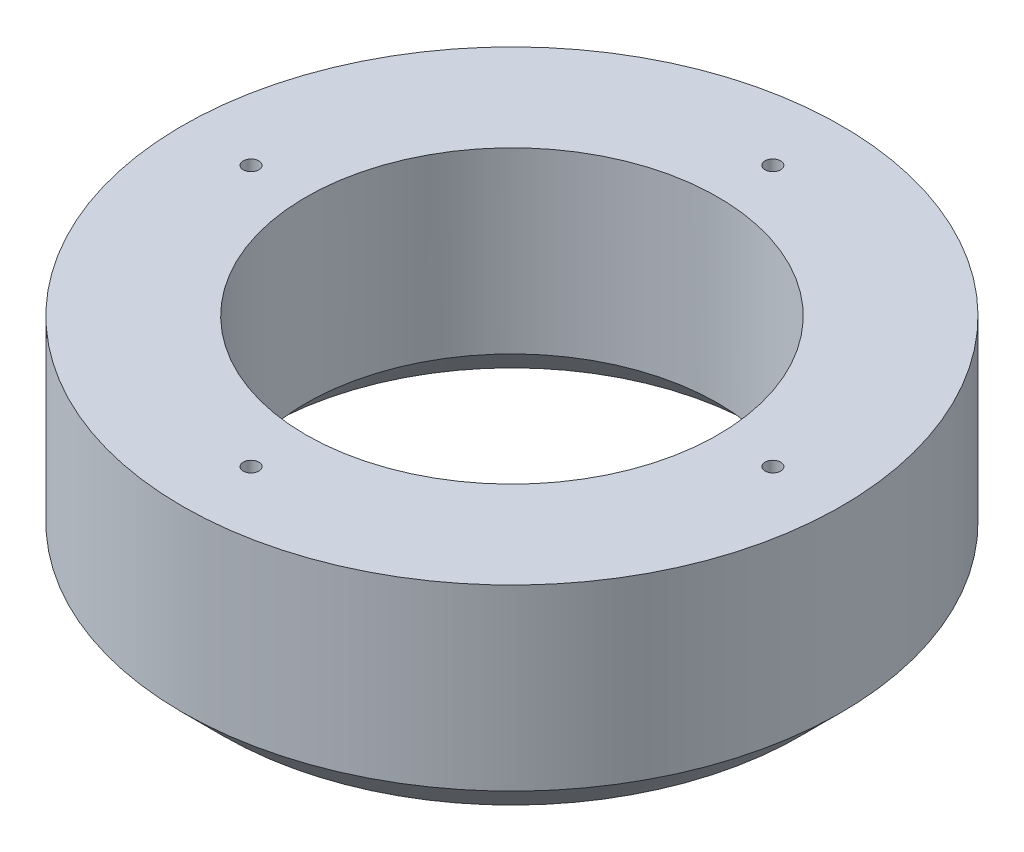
ISO-10303-21;
HEADER;
FILE_DESCRIPTION(('STEP AP214'),'2;1');
FILE_NAME('part.step','',(''),(''),'','','');
FILE_SCHEMA(('AUTOMOTIVE_DESIGN { 1 0 10303 214 1 1 1 1 }'));
ENDSEC;
DATA;
#1=APPLICATION_CONTEXT('core data for automotive mechanical design processes');
#2=APPLICATION_PROTOCOL_DEFINITION('international standard','automotive_design',2000,#1);
#3=PRODUCT_CONTEXT('',#1,'mechanical');
#4=PRODUCT('Part','Part','',(#3));
#5=PRODUCT_RELATED_PRODUCT_CATEGORY('part','',(#4));
#6=PRODUCT_DEFINITION_FORMATION('','',#4);
#7=PRODUCT_DEFINITION_CONTEXT('part definition',#1,'design');
#8=PRODUCT_DEFINITION('design','',#6,#7);
#9=PRODUCT_DEFINITION_SHAPE('','',#8);
#10=(LENGTH_UNIT() NAMED_UNIT(*) SI_UNIT(.MILLI.,.METRE.));
#11=(NAMED_UNIT(*) PLANE_ANGLE_UNIT() SI_UNIT($,.RADIAN.));
#12=(NAMED_UNIT(*) SI_UNIT($,.STERADIAN.) SOLID_ANGLE_UNIT());
#13=UNCERTAINTY_MEASURE_WITH_UNIT(LENGTH_MEASURE(1.E-05),#10,'distance_accuracy_value','');
#14=(GEOMETRIC_REPRESENTATION_CONTEXT(3) GLOBAL_UNCERTAINTY_ASSIGNED_CONTEXT((#13)) GLOBAL_UNIT_ASSIGNED_CONTEXT((#10,
#11,#12)) REPRESENTATION_CONTEXT('',''));
#15=CARTESIAN_POINT('',(0.,0.,0.));
#16=DIRECTION('',(0.,0.,1.));
#17=DIRECTION('',(1.,0.,0.));
#18=AXIS2_PLACEMENT_3D('',#15,#16,#17);
#19=CARTESIAN_POINT('',(0.,0.,0.));
#20=DIRECTION('',(0.,1.,0.));
#21=DIRECTION('',(0.,0.,1.));
#22=AXIS2_PLACEMENT_3D('',#19,#20,#21);
#23=CYLINDRICAL_SURFACE('',#22,381.);
#24=CARTESIAN_POINT('',(0.,-330.2,0.));
#25=DIRECTION('',(0.,1.,0.));
#26=DIRECTION('',(0.,0.,1.));
#27=AXIS2_PLACEMENT_3D('',#24,#25,#26);
#28=CIRCLE('',#27,381.);
#29=CARTESIAN_POINT('',(0.,-330.2,-381.));
#30=VERTEX_POINT('',#29);
#31=EDGE_CURVE('E10',#30,#30,#28,.F.);
#32=ORIENTED_EDGE('',*,*,#31,.T.);
#33=EDGE_LOOP('',(#32));
#34=FACE_BOUND('',#33,.T.);
#35=CARTESIAN_POINT('',(0.,0.,0.));
#36=DIRECTION('',(0.,1.,0.));
#37=DIRECTION('',(0.,0.,1.));
#38=AXIS2_PLACEMENT_3D('',#35,#36,#37);
#39=CIRCLE('',#38,381.);
#40=CARTESIAN_POINT('',(0.,0.,381.));
#41=VERTEX_POINT('',#40);
#42=EDGE_CURVE('E46',#41,#41,#39,.T.);
#43=ORIENTED_EDGE('',*,*,#42,.T.);
#44=EDGE_LOOP('',(#43));
#45=FACE_BOUND('',#44,.T.);
#46=ADVANCED_FACE('F24',(#34,#45),#23,.F.);
#47=CARTESIAN_POINT('',(381.,-406.4,0.));
#48=DIRECTION('',(0.,1.,0.));
#49=DIRECTION('',(0.,0.,1.));
#50=AXIS2_PLACEMENT_3D('',#47,#48,#49);
#51=PLANE('',#50);
#52=CARTESIAN_POINT('',(5.05496961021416E-12,-406.4,-482.6));
#53=DIRECTION('',(0.,1.,0.));
#54=DIRECTION('',(1.,0.,0.));
#55=AXIS2_PLACEMENT_3D('',#52,#53,#54);
#56=CIRCLE('',#55,14.4145);
#57=CARTESIAN_POINT('',(14.414500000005,-406.4,-482.6));
#58=VERTEX_POINT('',#57);
#59=EDGE_CURVE('E67',#58,#58,#56,.T.);
#60=ORIENTED_EDGE('',*,*,#59,.T.);
#61=EDGE_LOOP('',(#60));
#62=FACE_BOUND('',#61,.T.);
#63=CARTESIAN_POINT('',(-482.6,-406.4,-3.36997974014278E-12));
#64=DIRECTION('',(0.,1.,0.));
#65=DIRECTION('',(0.,0.,-1.));
#66=AXIS2_PLACEMENT_3D('',#63,#64,#65);
#67=CIRCLE('',#66,14.4145);
#68=CARTESIAN_POINT('',(-482.6,-406.4,-14.4145000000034));
#69=VERTEX_POINT('',#68);
#70=EDGE_CURVE('E61',#69,#69,#67,.T.);
#71=ORIENTED_EDGE('',*,*,#70,.T.);
#72=EDGE_LOOP('',(#71));
#73=FACE_BOUND('',#72,.T.);
#74=CARTESIAN_POINT('',(-1.68498987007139E-12,-406.4,482.6));
#75=DIRECTION('',(0.,1.,0.));
#76=DIRECTION('',(-1.,0.,0.));
#77=AXIS2_PLACEMENT_3D('',#74,#75,#76);
#78=CIRCLE('',#77,14.4145);
#79=CARTESIAN_POINT('',(-14.4145000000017,-406.4,482.6));
#80=VERTEX_POINT('',#79);
#81=EDGE_CURVE('E55',#80,#80,#78,.T.);
#82=ORIENTED_EDGE('',*,*,#81,.T.);
#83=EDGE_LOOP('',(#82));
#84=FACE_BOUND('',#83,.T.);
#85=CARTESIAN_POINT('',(482.6,-406.4,0.));
#86=DIRECTION('',(0.,1.,0.));
#87=DIRECTION('',(0.,0.,1.));
#88=AXIS2_PLACEMENT_3D('',#85,#86,#87);
#89=CIRCLE('',#88,14.4145);
#90=CARTESIAN_POINT('',(482.6,-406.4,14.4145));
#91=VERTEX_POINT('',#90);
#92=EDGE_CURVE('E49',#91,#91,#89,.T.);
#93=ORIENTED_EDGE('',*,*,#92,.T.);
#94=EDGE_LOOP('',(#93));
#95=FACE_BOUND('',#94,.T.);
#96=CARTESIAN_POINT('',(0.,-406.4,0.));
#97=DIRECTION('',(0.,1.,0.));
#98=DIRECTION('',(0.,0.,1.));
#99=AXIS2_PLACEMENT_3D('',#96,#97,#98);
#100=CIRCLE('',#99,457.2);
#101=CARTESIAN_POINT('',(0.,-406.4,-457.2));
#102=VERTEX_POINT('',#101);
#103=EDGE_CURVE('E30',#102,#102,#100,.T.);
#104=ORIENTED_EDGE('',*,*,#103,.T.);
#105=EDGE_LOOP('',(#104));
#106=FACE_BOUND('',#105,.T.);
#107=CARTESIAN_POINT('',(0.,-406.4,0.));
#108=DIRECTION('',(0.,1.,0.));
#109=DIRECTION('',(0.,0.,1.));
#110=AXIS2_PLACEMENT_3D('',#107,#108,#109);
#111=CIRCLE('',#110,533.4);
#112=CARTESIAN_POINT('',(0.,-406.4,533.4));
#113=VERTEX_POINT('',#112);
#114=EDGE_CURVE('E34',#113,#113,#111,.F.);
#115=ORIENTED_EDGE('',*,*,#114,.T.);
#116=EDGE_LOOP('',(#115));
#117=FACE_BOUND('',#116,.T.);
#118=ADVANCED_FACE('F93',(#62,#73,#84,#95,#106,#117),#51,.F.);
#119=CARTESIAN_POINT('',(0.,0.,0.));
#120=DIRECTION('',(0.,1.,0.));
#121=DIRECTION('',(0.,0.,1.));
#122=AXIS2_PLACEMENT_3D('',#119,#120,#121);
#123=CYLINDRICAL_SURFACE('',#122,609.6);
#124=CARTESIAN_POINT('',(0.,-330.2,0.));
#125=DIRECTION('',(0.,1.,0.));
#126=DIRECTION('',(0.,0.,1.));
#127=AXIS2_PLACEMENT_3D('',#124,#125,#126);
#128=CIRCLE('',#127,609.6);
#129=CARTESIAN_POINT('',(0.,-330.2,609.6));
#130=VERTEX_POINT('',#129);
#131=EDGE_CURVE('E38',#130,#130,#128,.T.);
#132=ORIENTED_EDGE('',*,*,#131,.T.);
#133=EDGE_LOOP('',(#132));
#134=FACE_BOUND('',#133,.T.);
#135=CARTESIAN_POINT('',(0.,0.,0.));
#136=DIRECTION('',(0.,1.,0.));
#137=DIRECTION('',(0.,0.,1.));
#138=AXIS2_PLACEMENT_3D('',#135,#136,#137);
#139=CIRCLE('',#138,609.6);
#140=CARTESIAN_POINT('',(0.,0.,609.6));
#141=VERTEX_POINT('',#140);
#142=EDGE_CURVE('E43',#141,#141,#139,.T.);
#143=ORIENTED_EDGE('',*,*,#142,.F.);
#144=EDGE_LOOP('',(#143));
#145=FACE_BOUND('',#144,.T.);
#146=ADVANCED_FACE('F80',(#134,#145),#123,.T.);
#147=CARTESIAN_POINT('',(381.,0.,0.));
#148=DIRECTION('',(0.,-1.,0.));
#149=DIRECTION('',(0.,0.,-1.));
#150=AXIS2_PLACEMENT_3D('',#147,#148,#149);
#151=PLANE('',#150);
#152=CARTESIAN_POINT('',(5.05496961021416E-12,0.,-482.6));
#153=DIRECTION('',(0.,1.,0.));
#154=DIRECTION('',(1.,0.,0.));
#155=AXIS2_PLACEMENT_3D('',#152,#153,#154);
#156=CIRCLE('',#155,14.4145);
#157=CARTESIAN_POINT('',(14.414500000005,0.,-482.6));
#158=VERTEX_POINT('',#157);
#159=EDGE_CURVE('E70',#158,#158,#156,.T.);
#160=ORIENTED_EDGE('',*,*,#159,.F.);
#161=EDGE_LOOP('',(#160));
#162=FACE_BOUND('',#161,.T.);
#163=CARTESIAN_POINT('',(-482.6,0.,-3.36997974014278E-12));
#164=DIRECTION('',(0.,1.,0.));
#165=DIRECTION('',(0.,0.,-1.));
#166=AXIS2_PLACEMENT_3D('',#163,#164,#165);
#167=CIRCLE('',#166,14.4145);
#168=CARTESIAN_POINT('',(-482.6,0.,-14.4145000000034));
#169=VERTEX_POINT('',#168);
#170=EDGE_CURVE('E64',#169,#169,#167,.T.);
#171=ORIENTED_EDGE('',*,*,#170,.F.);
#172=EDGE_LOOP('',(#171));
#173=FACE_BOUND('',#172,.T.);
#174=CARTESIAN_POINT('',(-1.68498987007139E-12,0.,482.6));
#175=DIRECTION('',(0.,1.,0.));
#176=DIRECTION('',(-1.,0.,0.));
#177=AXIS2_PLACEMENT_3D('',#174,#175,#176);
#178=CIRCLE('',#177,14.4145);
#179=CARTESIAN_POINT('',(-14.4145000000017,0.,482.6));
#180=VERTEX_POINT('',#179);
#181=EDGE_CURVE('E58',#180,#180,#178,.T.);
#182=ORIENTED_EDGE('',*,*,#181,.F.);
#183=EDGE_LOOP('',(#182));
#184=FACE_BOUND('',#183,.T.);
#185=CARTESIAN_POINT('',(482.6,0.,0.));
#186=DIRECTION('',(0.,1.,0.));
#187=DIRECTION('',(0.,0.,1.));
#188=AXIS2_PLACEMENT_3D('',#185,#186,#187);
#189=CIRCLE('',#188,14.4145);
#190=CARTESIAN_POINT('',(482.6,0.,14.4145));
#191=VERTEX_POINT('',#190);
#192=EDGE_CURVE('E52',#191,#191,#189,.T.);
#193=ORIENTED_EDGE('',*,*,#192,.F.);
#194=EDGE_LOOP('',(#193));
#195=FACE_BOUND('',#194,.T.);
#196=ORIENTED_EDGE('',*,*,#42,.F.);
#197=EDGE_LOOP('',(#196));
#198=FACE_BOUND('',#197,.T.);
#199=ORIENTED_EDGE('',*,*,#142,.T.);
#200=EDGE_LOOP('',(#199));
#201=FACE_BOUND('',#200,.T.);
#202=ADVANCED_FACE('F76',(#162,#173,#184,#195,#198,#201),#151,.F.);
#203=CARTESIAN_POINT('',(0.,-330.2,0.));
#204=DIRECTION('',(0.,1.,0.));
#205=DIRECTION('',(0.,0.,1.));
#206=AXIS2_PLACEMENT_3D('',#203,#204,#205);
#207=CONICAL_SURFACE('',#206,609.6,0.785398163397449);
#208=ORIENTED_EDGE('',*,*,#114,.F.);
#209=EDGE_LOOP('',(#208));
#210=FACE_BOUND('',#209,.T.);
#211=ORIENTED_EDGE('',*,*,#131,.F.);
#212=EDGE_LOOP('',(#211));
#213=FACE_BOUND('',#212,.T.);
#214=ADVANCED_FACE('F79',(#210,#213),#207,.T.);
#215=CARTESIAN_POINT('',(0.,-406.4,0.));
#216=DIRECTION('',(0.,-1.,0.));
#217=DIRECTION('',(0.,0.,-1.));
#218=AXIS2_PLACEMENT_3D('',#215,#216,#217);
#219=CONICAL_SURFACE('',#218,457.2,0.785398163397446);
#220=CARTESIAN_POINT('',(0.,-330.2,-381.));
#221=CARTESIAN_POINT('',(0.,-330.99375,-381.79375));
#222=CARTESIAN_POINT('',(0.,-331.7875,-382.5875));
#223=CARTESIAN_POINT('',(0.,-333.375,-384.175));
#224=CARTESIAN_POINT('',(0.,-334.16875,-384.96875));
#225=CARTESIAN_POINT('',(0.,-335.75625,-386.55625));
#226=CARTESIAN_POINT('',(0.,-336.55,-387.35));
#227=CARTESIAN_POINT('',(0.,-338.1375,-388.9375));
#228=CARTESIAN_POINT('',(0.,-338.93125,-389.73125));
#229=CARTESIAN_POINT('',(0.,-340.51875,-391.31875));
#230=CARTESIAN_POINT('',(0.,-341.3125,-392.1125));
#231=CARTESIAN_POINT('',(0.,-342.9,-393.7));
#232=CARTESIAN_POINT('',(0.,-343.69375,-394.49375));
#233=CARTESIAN_POINT('',(0.,-345.28125,-396.08125));
#234=CARTESIAN_POINT('',(0.,-346.075,-396.875));
#235=CARTESIAN_POINT('',(0.,-347.6625,-398.4625));
#236=CARTESIAN_POINT('',(0.,-348.45625,-399.25625));
#237=CARTESIAN_POINT('',(0.,-350.04375,-400.84375));
#238=CARTESIAN_POINT('',(0.,-350.8375,-401.6375));
#239=CARTESIAN_POINT('',(0.,-352.425,-403.225));
#240=CARTESIAN_POINT('',(0.,-353.21875,-404.01875));
#241=CARTESIAN_POINT('',(0.,-354.80625,-405.60625));
#242=CARTESIAN_POINT('',(0.,-355.6,-406.4));
#243=CARTESIAN_POINT('',(0.,-357.1875,-407.9875));
#244=CARTESIAN_POINT('',(0.,-357.98125,-408.78125));
#245=CARTESIAN_POINT('',(0.,-359.56875,-410.36875));
#246=CARTESIAN_POINT('',(0.,-360.3625,-411.1625));
#247=CARTESIAN_POINT('',(0.,-361.95,-412.75));
#248=CARTESIAN_POINT('',(0.,-362.74375,-413.54375));
#249=CARTESIAN_POINT('',(0.,-364.33125,-415.13125));
#250=CARTESIAN_POINT('',(0.,-365.125,-415.925));
#251=CARTESIAN_POINT('',(0.,-366.7125,-417.5125));
#252=CARTESIAN_POINT('',(0.,-367.50625,-418.30625));
#253=CARTESIAN_POINT('',(0.,-369.09375,-419.89375));
#254=CARTESIAN_POINT('',(0.,-369.8875,-420.6875));
#255=CARTESIAN_POINT('',(0.,-371.475,-422.275));
#256=CARTESIAN_POINT('',(0.,-372.26875,-423.06875));
#257=CARTESIAN_POINT('',(0.,-373.85625,-424.65625));
#258=CARTESIAN_POINT('',(0.,-374.65,-425.45));
#259=CARTESIAN_POINT('',(0.,-376.2375,-427.0375));
#260=CARTESIAN_POINT('',(0.,-377.03125,-427.83125));
#261=CARTESIAN_POINT('',(0.,-378.61875,-429.41875));
#262=CARTESIAN_POINT('',(0.,-379.4125,-430.2125));
#263=CARTESIAN_POINT('',(0.,-381.,-431.8));
#264=CARTESIAN_POINT('',(0.,-381.79375,-432.59375));
#265=CARTESIAN_POINT('',(0.,-383.38125,-434.18125));
#266=CARTESIAN_POINT('',(0.,-384.175,-434.975));
#267=CARTESIAN_POINT('',(0.,-385.7625,-436.5625));
#268=CARTESIAN_POINT('',(0.,-386.55625,-437.35625));
#269=CARTESIAN_POINT('',(0.,-388.14375,-438.94375));
#270=CARTESIAN_POINT('',(0.,-388.9375,-439.7375));
#271=CARTESIAN_POINT('',(0.,-390.525,-441.325));
#272=CARTESIAN_POINT('',(0.,-391.31875,-442.11875));
#273=CARTESIAN_POINT('',(0.,-392.90625,-443.70625));
#274=CARTESIAN_POINT('',(0.,-393.7,-444.5));
#275=CARTESIAN_POINT('',(0.,-395.2875,-446.0875));
#276=CARTESIAN_POINT('',(0.,-396.08125,-446.88125));
#277=CARTESIAN_POINT('',(0.,-397.66875,-448.46875));
#278=CARTESIAN_POINT('',(0.,-398.4625,-449.2625));
#279=CARTESIAN_POINT('',(0.,-400.05,-450.85));
#280=CARTESIAN_POINT('',(0.,-400.84375,-451.64375));
#281=CARTESIAN_POINT('',(0.,-402.43125,-453.23125));
#282=CARTESIAN_POINT('',(0.,-403.225,-454.025));
#283=CARTESIAN_POINT('',(0.,-404.8125,-455.6125));
#284=CARTESIAN_POINT('',(0.,-405.60625,-456.40625));
#285=CARTESIAN_POINT('',(0.,-406.4,-457.2));
#286=B_SPLINE_CURVE_WITH_KNOTS('',3,(#220,#221,#222,#223,#224,#225,#226,#227,#228,#229,#230,
#231,#232,#233,#234,#235,#236,#237,#238,#239,#240,#241,#242,#243,#244,#245,#246,#247,#248,#249,
#250,#251,#252,#253,#254,#255,#256,#257,#258,#259,#260,#261,#262,#263,#264,#265,#266,#267,#268,
#269,#270,#271,#272,#273,#274,#275,#276,#277,#278,#279,#280,#281,#282,#283,#284,#285),
.UNSPECIFIED.,.F.,.F.,(4,2,2,2,2,2,2,2,2,2,2,2,2,2,2,2,2,2,2,2,2,2,2,2,2,2,2,2,2,2,2,2,4),(0.,
3.36759604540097,6.73519209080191,10.1027881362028,13.4703841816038,16.8379802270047,
20.2055762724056,23.5731723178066,26.9407683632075,30.3083644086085,33.6759604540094,
37.0435564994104,40.4111525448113,43.7787485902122,47.1463446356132,50.5139406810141,
53.8815367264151,57.249132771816,60.6167288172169,63.9843248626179,67.3519209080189,
70.7195169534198,74.0871129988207,77.4547090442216,80.8223050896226,84.1899011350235,
87.5574971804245,90.9250932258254,94.2926892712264,97.6602853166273,101.027881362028,
104.395477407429,107.76307345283),.UNSPECIFIED.);
#287=EDGE_CURVE('BSEAM111',#30,#102,#286,.T.);
#288=ORIENTED_EDGE('',*,*,#31,.F.);
#289=ORIENTED_EDGE('',*,*,#103,.F.);
#290=ORIENTED_EDGE('',*,*,#287,.T.);
#291=ORIENTED_EDGE('',*,*,#287,.F.);
#292=EDGE_LOOP('',(#288,#290,#289,#291));
#293=FACE_BOUND('',#292,.T.);
#294=ADVANCED_FACE('F111',(#293),#219,.F.);
#295=CARTESIAN_POINT('',(482.6,-406.4,0.));
#296=DIRECTION('',(0.,1.,0.));
#297=DIRECTION('',(0.,0.,1.));
#298=AXIS2_PLACEMENT_3D('',#295,#296,#297);
#299=CYLINDRICAL_SURFACE('',#298,14.4145);
#300=ORIENTED_EDGE('',*,*,#92,.F.);
#301=EDGE_LOOP('',(#300));
#302=FACE_BOUND('',#301,.T.);
#303=ORIENTED_EDGE('',*,*,#192,.T.);
#304=EDGE_LOOP('',(#303));
#305=FACE_BOUND('',#304,.T.);
#306=ADVANCED_FACE('F115',(#302,#305),#299,.F.);
#307=CARTESIAN_POINT('',(-1.68498987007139E-12,-406.4,482.6));
#308=DIRECTION('',(0.,1.,0.));
#309=DIRECTION('',(0.,0.,1.));
#310=AXIS2_PLACEMENT_3D('',#307,#308,#309);
#311=CYLINDRICAL_SURFACE('',#310,14.4145);
#312=ORIENTED_EDGE('',*,*,#81,.F.);
#313=EDGE_LOOP('',(#312));
#314=FACE_BOUND('',#313,.T.);
#315=ORIENTED_EDGE('',*,*,#181,.T.);
#316=EDGE_LOOP('',(#315));
#317=FACE_BOUND('',#316,.T.);
#318=ADVANCED_FACE('F122',(#314,#317),#311,.F.);
#319=CARTESIAN_POINT('',(-482.6,-406.4,-3.36997974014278E-12));
#320=DIRECTION('',(0.,1.,0.));
#321=DIRECTION('',(0.,0.,1.));
#322=AXIS2_PLACEMENT_3D('',#319,#320,#321);
#323=CYLINDRICAL_SURFACE('',#322,14.4145);
#324=ORIENTED_EDGE('',*,*,#70,.F.);
#325=EDGE_LOOP('',(#324));
#326=FACE_BOUND('',#325,.T.);
#327=ORIENTED_EDGE('',*,*,#170,.T.);
#328=EDGE_LOOP('',(#327));
#329=FACE_BOUND('',#328,.T.);
#330=ADVANCED_FACE('F138',(#326,#329),#323,.F.);
#331=CARTESIAN_POINT('',(5.05496961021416E-12,-406.4,-482.6));
#332=DIRECTION('',(0.,1.,0.));
#333=DIRECTION('',(0.,0.,1.));
#334=AXIS2_PLACEMENT_3D('',#331,#332,#333);
#335=CYLINDRICAL_SURFACE('',#334,14.4145);
#336=ORIENTED_EDGE('',*,*,#59,.F.);
#337=EDGE_LOOP('',(#336));
#338=FACE_BOUND('',#337,.T.);
#339=ORIENTED_EDGE('',*,*,#159,.T.);
#340=EDGE_LOOP('',(#339));
#341=FACE_BOUND('',#340,.T.);
#342=ADVANCED_FACE('F74',(#338,#341),#335,.F.);
#343=CLOSED_SHELL('',(#46,#118,#146,#202,#214,#294,#306,#318,#330,#342));
#344=MANIFOLD_SOLID_BREP('B2',#343);
#345=ADVANCED_BREP_SHAPE_REPRESENTATION('',(#18,#344),#14);
#346=SHAPE_DEFINITION_REPRESENTATION(#9,#345);
ENDSEC;
END-ISO-10303-21;
